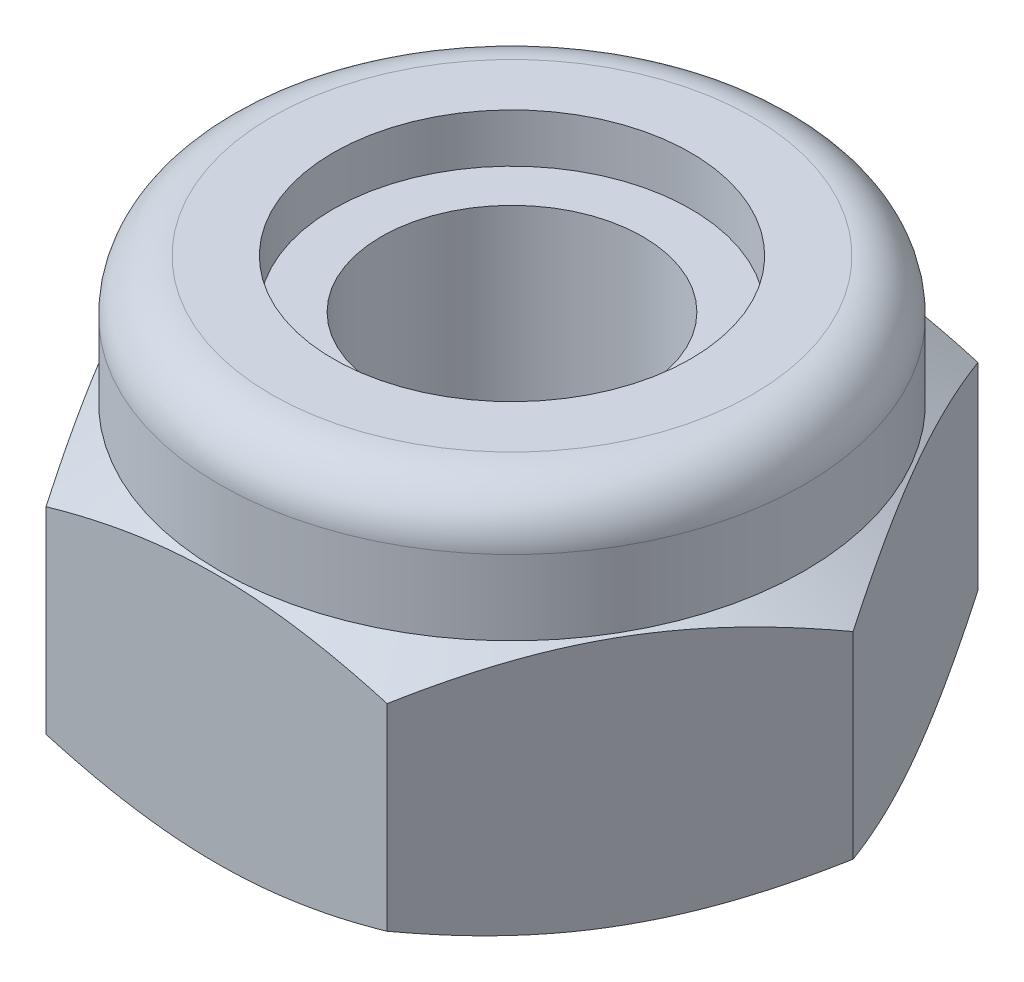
ISO-10303-21;
HEADER;
FILE_DESCRIPTION(('STEP AP214'),'2;1');
FILE_NAME('part.step','',(''),(''),'','','');
FILE_SCHEMA(('AUTOMOTIVE_DESIGN { 1 0 10303 214 1 1 1 1 }'));
ENDSEC;
DATA;
#1=APPLICATION_CONTEXT('core data for automotive mechanical design processes');
#2=APPLICATION_PROTOCOL_DEFINITION('international standard','automotive_design',2000,#1);
#3=PRODUCT_CONTEXT('',#1,'mechanical');
#4=PRODUCT('Part','Part','',(#3));
#5=PRODUCT_RELATED_PRODUCT_CATEGORY('part','',(#4));
#6=PRODUCT_DEFINITION_FORMATION('','',#4);
#7=PRODUCT_DEFINITION_CONTEXT('part definition',#1,'design');
#8=PRODUCT_DEFINITION('design','',#6,#7);
#9=PRODUCT_DEFINITION_SHAPE('','',#8);
#10=(LENGTH_UNIT() NAMED_UNIT(*) SI_UNIT(.MILLI.,.METRE.));
#11=(NAMED_UNIT(*) PLANE_ANGLE_UNIT() SI_UNIT($,.RADIAN.));
#12=(NAMED_UNIT(*) SI_UNIT($,.STERADIAN.) SOLID_ANGLE_UNIT());
#13=UNCERTAINTY_MEASURE_WITH_UNIT(LENGTH_MEASURE(1.E-05),#10,'distance_accuracy_value','');
#14=(GEOMETRIC_REPRESENTATION_CONTEXT(3) GLOBAL_UNCERTAINTY_ASSIGNED_CONTEXT((#13)) GLOBAL_UNIT_ASSIGNED_CONTEXT((#10,
#11,#12)) REPRESENTATION_CONTEXT('',''));
#15=CARTESIAN_POINT('',(0.,0.,0.));
#16=DIRECTION('',(0.,0.,1.));
#17=DIRECTION('',(1.,0.,0.));
#18=AXIS2_PLACEMENT_3D('',#15,#16,#17);
#19=CARTESIAN_POINT('',(-4.00050000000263,5.9436,2.30968975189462));
#20=DIRECTION('',(0.866025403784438,0.,-0.5));
#21=DIRECTION('',(0.,-1.,0.));
#22=AXIS2_PLACEMENT_3D('',#19,#20,#21);
#23=PLANE('',#22);
#24=CARTESIAN_POINT('',(-5.33400000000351,0.439940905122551,0.));
#25=CARTESIAN_POINT('',(-5.21680150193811,0.372256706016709,0.202993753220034));
#26=CARTESIAN_POINT('',(-5.09859134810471,0.310701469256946,0.407739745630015));
#27=CARTESIAN_POINT('',(-4.86012431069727,0.203258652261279,0.820776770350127));
#28=CARTESIAN_POINT('',(-4.73986319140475,0.157409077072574,1.02907513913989));
#29=CARTESIAN_POINT('',(-4.50083128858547,0.0860409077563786,1.44309053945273));
#30=CARTESIAN_POINT('',(-4.38209727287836,0.0600472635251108,1.64874388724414));
#31=CARTESIAN_POINT('',(-4.14407085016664,0.0290220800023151,2.0610177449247));
#32=CARTESIAN_POINT('',(-4.02477930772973,0.0239648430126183,2.26763675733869));
#33=CARTESIAN_POINT('',(-3.80189585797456,0.0345124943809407,2.65368221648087));
#34=CARTESIAN_POINT('',(-3.69827050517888,0.0475275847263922,2.83316659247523));
#35=CARTESIAN_POINT('',(-3.49169488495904,0.0887694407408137,3.19096606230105));
#36=CARTESIAN_POINT('',(-3.3887453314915,0.117010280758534,3.36927991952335));
#37=CARTESIAN_POINT('',(-3.18174414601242,0.187606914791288,3.72781649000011));
#38=CARTESIAN_POINT('',(-3.07771869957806,0.230261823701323,3.90799384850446));
#39=CARTESIAN_POINT('',(-2.87121889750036,0.327070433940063,4.26566199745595));
#40=CARTESIAN_POINT('',(-2.76874189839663,0.381201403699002,4.4431573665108));
#41=CARTESIAN_POINT('',(-2.66700000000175,0.439940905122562,4.61937950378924));
#42=B_SPLINE_CURVE_WITH_KNOTS('',3,(#24,#25,#26,#27,#28,#29,#30,#31,#32,#33,#34,#35,#36,#37,#38,
#39,#40,#41),.UNSPECIFIED.,.F.,.F.,(4,2,2,2,2,2,2,2,4),(0.,0.732208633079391,1.46617677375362,
2.18198147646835,2.89690732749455,3.51929225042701,4.14225348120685,4.77902900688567,
5.4145548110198),.UNSPECIFIED.);
#43=CARTESIAN_POINT('',(-5.33400000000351,0.439940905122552,0.));
#44=VERTEX_POINT('',#43);
#45=CARTESIAN_POINT('',(-2.66700000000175,0.439940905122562,4.61937950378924));
#46=VERTEX_POINT('',#45);
#47=EDGE_CURVE('E237',#44,#46,#42,.T.);
#48=ORIENTED_EDGE('',*,*,#47,.T.);
#49=DIRECTION('',(0.,-1.,0.));
#50=VECTOR('',#49,1.);
#51=CARTESIAN_POINT('',(-2.66700000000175,5.9436,4.61937950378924));
#52=LINE('',#51,#50);
#53=CARTESIAN_POINT('',(-2.66700000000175,3.52245909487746,4.61937950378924));
#54=VERTEX_POINT('',#53);
#55=EDGE_CURVE('E92',#54,#46,#52,.T.);
#56=ORIENTED_EDGE('',*,*,#55,.F.);
#57=CARTESIAN_POINT('',(-2.66700000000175,3.52245909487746,4.61937950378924));
#58=CARTESIAN_POINT('',(-2.78419849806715,3.5901432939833,4.41638575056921));
#59=CARTESIAN_POINT('',(-2.90240865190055,3.65169853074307,4.21163975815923));
#60=CARTESIAN_POINT('',(-3.14087568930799,3.75914134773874,3.79860273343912));
#61=CARTESIAN_POINT('',(-3.26113680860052,3.80499092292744,3.59030436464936));
#62=CARTESIAN_POINT('',(-3.50016871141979,3.87635909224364,3.17628896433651));
#63=CARTESIAN_POINT('',(-3.61890272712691,3.90235273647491,2.9706356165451));
#64=CARTESIAN_POINT('',(-3.85692914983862,3.93337791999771,2.55836175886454));
#65=CARTESIAN_POINT('',(-3.97622069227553,3.9384351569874,2.35174274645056));
#66=CARTESIAN_POINT('',(-4.1991041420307,3.92788750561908,1.96569728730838));
#67=CARTESIAN_POINT('',(-4.30272949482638,3.91487241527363,1.78621291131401));
#68=CARTESIAN_POINT('',(-4.50930511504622,3.87363055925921,1.4284134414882));
#69=CARTESIAN_POINT('',(-4.61225466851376,3.84538971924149,1.2500995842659));
#70=CARTESIAN_POINT('',(-4.81925585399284,3.77479308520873,0.891563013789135));
#71=CARTESIAN_POINT('',(-4.9232813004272,3.7321381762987,0.711385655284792));
#72=CARTESIAN_POINT('',(-5.1297811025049,3.63532956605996,0.353717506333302));
#73=CARTESIAN_POINT('',(-5.23225810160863,3.58119859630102,0.176222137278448));
#74=CARTESIAN_POINT('',(-5.33400000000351,3.52245909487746,0.));
#75=B_SPLINE_CURVE_WITH_KNOTS('',3,(#57,#58,#59,#60,#61,#62,#63,#64,#65,#66,#67,#68,#69,#70,#71,
#72,#73,#74),.UNSPECIFIED.,.F.,.F.,(4,2,2,2,2,2,2,2,4),(0.,0.732208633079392,1.46617677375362,
2.18198147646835,2.89690732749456,3.51929225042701,4.14225348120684,4.77902900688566,
5.4145548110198),.UNSPECIFIED.);
#76=CARTESIAN_POINT('',(-5.33400000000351,3.52245909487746,0.));
#77=VERTEX_POINT('',#76);
#78=EDGE_CURVE('E22',#54,#77,#75,.T.);
#79=ORIENTED_EDGE('',*,*,#78,.T.);
#80=DIRECTION('',(0.,-1.,0.));
#81=VECTOR('',#80,1.);
#82=CARTESIAN_POINT('',(-5.33400000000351,5.9436,0.));
#83=LINE('',#82,#81);
#84=EDGE_CURVE('E11',#77,#44,#83,.T.);
#85=ORIENTED_EDGE('',*,*,#84,.T.);
#86=EDGE_LOOP('',(#48,#56,#79,#85));
#87=FACE_BOUND('',#86,.T.);
#88=ADVANCED_FACE('F17',(#87),#23,.F.);
#89=CARTESIAN_POINT('',(-4.00050000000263,5.9436,-2.30968975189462));
#90=DIRECTION('',(0.866025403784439,0.,0.5));
#91=DIRECTION('',(0.,-1.,0.));
#92=AXIS2_PLACEMENT_3D('',#89,#90,#91);
#93=PLANE('',#92);
#94=CARTESIAN_POINT('',(-2.66700000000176,0.439940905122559,-4.61937950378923));
#95=CARTESIAN_POINT('',(-2.78419849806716,0.372256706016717,-4.4163857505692));
#96=CARTESIAN_POINT('',(-2.90240865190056,0.310701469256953,-4.21163975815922));
#97=CARTESIAN_POINT('',(-3.14087568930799,0.203258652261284,-3.79860273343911));
#98=CARTESIAN_POINT('',(-3.26113680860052,0.157409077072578,-3.59030436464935));
#99=CARTESIAN_POINT('',(-3.50016871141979,0.0860409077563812,-3.1762889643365));
#100=CARTESIAN_POINT('',(-3.61890272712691,0.0600472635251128,-2.97063561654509));
#101=CARTESIAN_POINT('',(-3.85692914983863,0.0290220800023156,-2.55836175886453));
#102=CARTESIAN_POINT('',(-3.97622069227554,0.0239648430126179,-2.35174274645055));
#103=CARTESIAN_POINT('',(-4.19910414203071,0.034512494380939,-1.96569728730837));
#104=CARTESIAN_POINT('',(-4.30272949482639,0.0475275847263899,-1.786212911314));
#105=CARTESIAN_POINT('',(-4.50930511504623,0.0887694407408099,-1.42841344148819));
#106=CARTESIAN_POINT('',(-4.61225466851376,0.117010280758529,-1.25009958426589));
#107=CARTESIAN_POINT('',(-4.81925585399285,0.187606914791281,-0.891563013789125));
#108=CARTESIAN_POINT('',(-4.9232813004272,0.230261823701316,-0.711385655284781));
#109=CARTESIAN_POINT('',(-5.1297811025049,0.327070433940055,-0.35371750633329));
#110=CARTESIAN_POINT('',(-5.23225810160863,0.381201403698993,-0.176222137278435));
#111=CARTESIAN_POINT('',(-5.33400000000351,0.439940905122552,0.));
#112=B_SPLINE_CURVE_WITH_KNOTS('',3,(#94,#95,#96,#97,#98,#99,#100,#101,#102,#103,#104,#105,#106,
#107,#108,#109,#110,#111),.UNSPECIFIED.,.F.,.F.,(4,2,2,2,2,2,2,2,4),(0.,0.732208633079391,
1.46617677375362,2.18198147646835,2.89690732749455,3.519292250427,4.14225348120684,
4.77902900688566,5.4145548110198),.UNSPECIFIED.);
#113=CARTESIAN_POINT('',(-2.66700000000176,0.439940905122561,-4.61937950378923));
#114=VERTEX_POINT('',#113);
#115=EDGE_CURVE('E103',#114,#44,#112,.T.);
#116=ORIENTED_EDGE('',*,*,#115,.T.);
#117=ORIENTED_EDGE('',*,*,#84,.F.);
#118=CARTESIAN_POINT('',(-5.33400000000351,3.52245909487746,0.));
#119=CARTESIAN_POINT('',(-5.21680150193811,3.5901432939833,-0.202993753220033));
#120=CARTESIAN_POINT('',(-5.09859134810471,3.65169853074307,-0.407739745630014));
#121=CARTESIAN_POINT('',(-4.86012431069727,3.75914134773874,-0.820776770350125));
#122=CARTESIAN_POINT('',(-4.73986319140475,3.80499092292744,-1.02907513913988));
#123=CARTESIAN_POINT('',(-4.50083128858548,3.87635909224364,-1.44309053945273));
#124=CARTESIAN_POINT('',(-4.38209727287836,3.90235273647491,-1.64874388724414));
#125=CARTESIAN_POINT('',(-4.14407085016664,3.93337791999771,-2.0610177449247));
#126=CARTESIAN_POINT('',(-4.02477930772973,3.9384351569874,-2.26763675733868));
#127=CARTESIAN_POINT('',(-3.80189585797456,3.92788750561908,-2.65368221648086));
#128=CARTESIAN_POINT('',(-3.69827050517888,3.91487241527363,-2.83316659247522));
#129=CARTESIAN_POINT('',(-3.49169488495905,3.87363055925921,-3.19096606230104));
#130=CARTESIAN_POINT('',(-3.38874533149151,3.84538971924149,-3.36927991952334));
#131=CARTESIAN_POINT('',(-3.18174414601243,3.77479308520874,-3.7278164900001));
#132=CARTESIAN_POINT('',(-3.07771869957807,3.7321381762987,-3.90799384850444));
#133=CARTESIAN_POINT('',(-2.87121889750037,3.63532956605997,-4.26566199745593));
#134=CARTESIAN_POINT('',(-2.76874189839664,3.58119859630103,-4.44315736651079));
#135=CARTESIAN_POINT('',(-2.66700000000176,3.52245909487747,-4.61937950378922));
#136=B_SPLINE_CURVE_WITH_KNOTS('',3,(#118,#119,#120,#121,#122,#123,#124,#125,#126,#127,#128,
#129,#130,#131,#132,#133,#134,#135),.UNSPECIFIED.,.F.,.F.,(4,2,2,2,2,2,2,2,4),(0.,
0.732208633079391,1.46617677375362,2.18198147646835,2.89690732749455,3.519292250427,
4.14225348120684,4.77902900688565,5.41455481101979),.UNSPECIFIED.);
#137=CARTESIAN_POINT('',(-2.66700000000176,3.52245909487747,-4.61937950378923));
#138=VERTEX_POINT('',#137);
#139=EDGE_CURVE('E100',#77,#138,#136,.T.);
#140=ORIENTED_EDGE('',*,*,#139,.T.);
#141=DIRECTION('',(0.,-1.,0.));
#142=VECTOR('',#141,1.);
#143=CARTESIAN_POINT('',(-2.66700000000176,5.9436,-4.61937950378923));
#144=LINE('',#143,#142);
#145=EDGE_CURVE('E35',#138,#114,#144,.T.);
#146=ORIENTED_EDGE('',*,*,#145,.T.);
#147=EDGE_LOOP('',(#116,#117,#140,#146));
#148=FACE_BOUND('',#147,.T.);
#149=ADVANCED_FACE('F19',(#148),#93,.F.);
#150=CARTESIAN_POINT('',(0.,5.9436,-4.61937950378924));
#151=DIRECTION('',(0.,0.,1.));
#152=DIRECTION('',(1.,0.,0.));
#153=AXIS2_PLACEMENT_3D('',#150,#151,#152);
#154=PLANE('',#153);
#155=CARTESIAN_POINT('',(2.66700000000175,0.439940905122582,-4.61937950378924));
#156=CARTESIAN_POINT('',(2.43260300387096,0.37225670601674,-4.61937950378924));
#157=CARTESIAN_POINT('',(2.19618269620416,0.310701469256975,-4.61937950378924));
#158=CARTESIAN_POINT('',(1.71924862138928,0.203258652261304,-4.61937950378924));
#159=CARTESIAN_POINT('',(1.47872638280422,0.157409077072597,-4.61937950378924));
#160=CARTESIAN_POINT('',(1.00066257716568,0.0860409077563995,-4.61937950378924));
#161=CARTESIAN_POINT('',(0.763194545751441,0.0600472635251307,-4.61937950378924));
#162=CARTESIAN_POINT('',(0.287141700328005,0.0290220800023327,-4.61937950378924));
#163=CARTESIAN_POINT('',(0.0485586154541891,0.0239648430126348,-4.61937950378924));
#164=CARTESIAN_POINT('',(-0.397208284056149,0.0345124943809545,-4.61937950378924));
#165=CARTESIAN_POINT('',(-0.604458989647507,0.0475275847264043,-4.61937950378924));
#166=CARTESIAN_POINT('',(-1.01761023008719,0.0887694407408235,-4.61937950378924));
#167=CARTESIAN_POINT('',(-1.22350933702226,0.117010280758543,-4.61937950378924));
#168=CARTESIAN_POINT('',(-1.63751170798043,0.187606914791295,-4.61937950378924));
#169=CARTESIAN_POINT('',(-1.84556260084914,0.230261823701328,-4.61937950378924));
#170=CARTESIAN_POINT('',(-2.25856220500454,0.327070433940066,-4.61937950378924));
#171=CARTESIAN_POINT('',(-2.463516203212,0.381201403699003,-4.61937950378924));
#172=CARTESIAN_POINT('',(-2.66700000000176,0.439940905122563,-4.61937950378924));
#173=B_SPLINE_CURVE_WITH_KNOTS('',3,(#155,#156,#157,#158,#159,#160,#161,#162,#163,#164,#165,
#166,#167,#168,#169,#170,#171,#172),.UNSPECIFIED.,.F.,.F.,(4,2,2,2,2,2,2,2,4),(0.,
0.732208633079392,1.46617677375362,2.18198147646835,2.89690732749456,3.51929225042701,
4.14225348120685,4.77902900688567,5.4145548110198),.UNSPECIFIED.);
#174=CARTESIAN_POINT('',(2.66700000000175,0.439940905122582,-4.61937950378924));
#175=VERTEX_POINT('',#174);
#176=EDGE_CURVE('E224',#175,#114,#173,.T.);
#177=ORIENTED_EDGE('',*,*,#176,.T.);
#178=ORIENTED_EDGE('',*,*,#145,.F.);
#179=CARTESIAN_POINT('',(-2.66700000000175,3.52245909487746,-4.61937950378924));
#180=CARTESIAN_POINT('',(-2.43260300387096,3.59014329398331,-4.61937950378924));
#181=CARTESIAN_POINT('',(-2.19618269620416,3.65169853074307,-4.61937950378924));
#182=CARTESIAN_POINT('',(-1.71924862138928,3.75914134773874,-4.61937950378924));
#183=CARTESIAN_POINT('',(-1.47872638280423,3.80499092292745,-4.61937950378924));
#184=CARTESIAN_POINT('',(-1.00066257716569,3.87635909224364,-4.61937950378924));
#185=CARTESIAN_POINT('',(-0.763194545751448,3.90235273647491,-4.61937950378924));
#186=CARTESIAN_POINT('',(-0.287141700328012,3.93337791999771,-4.61937950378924));
#187=CARTESIAN_POINT('',(-0.0485586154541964,3.93843515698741,-4.61937950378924));
#188=CARTESIAN_POINT('',(0.397208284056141,3.92788750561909,-4.61937950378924));
#189=CARTESIAN_POINT('',(0.604458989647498,3.91487241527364,-4.61937950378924));
#190=CARTESIAN_POINT('',(1.01761023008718,3.87363055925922,-4.61937950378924));
#191=CARTESIAN_POINT('',(1.22350933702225,3.8453897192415,-4.61937950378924));
#192=CARTESIAN_POINT('',(1.63751170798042,3.77479308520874,-4.61937950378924));
#193=CARTESIAN_POINT('',(1.84556260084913,3.73213817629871,-4.61937950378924));
#194=CARTESIAN_POINT('',(2.25856220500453,3.63532956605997,-4.61937950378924));
#195=CARTESIAN_POINT('',(2.46351620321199,3.58119859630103,-4.61937950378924));
#196=CARTESIAN_POINT('',(2.66700000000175,3.52245909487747,-4.61937950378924));
#197=B_SPLINE_CURVE_WITH_KNOTS('',3,(#179,#180,#181,#182,#183,#184,#185,#186,#187,#188,#189,
#190,#191,#192,#193,#194,#195,#196),.UNSPECIFIED.,.F.,.F.,(4,2,2,2,2,2,2,2,4),(0.,
0.732208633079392,1.46617677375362,2.18198147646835,2.89690732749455,3.519292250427,
4.14225348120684,4.77902900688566,5.41455481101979),.UNSPECIFIED.);
#198=CARTESIAN_POINT('',(2.66700000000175,3.52245909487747,-4.61937950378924));
#199=VERTEX_POINT('',#198);
#200=EDGE_CURVE('E111',#138,#199,#197,.T.);
#201=ORIENTED_EDGE('',*,*,#200,.T.);
#202=DIRECTION('',(0.,-1.,0.));
#203=VECTOR('',#202,1.);
#204=CARTESIAN_POINT('',(2.66700000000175,5.9436,-4.61937950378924));
#205=LINE('',#204,#203);
#206=EDGE_CURVE('E143',#199,#175,#205,.T.);
#207=ORIENTED_EDGE('',*,*,#206,.T.);
#208=EDGE_LOOP('',(#177,#178,#201,#207));
#209=FACE_BOUND('',#208,.T.);
#210=ADVANCED_FACE('F212',(#209),#154,.F.);
#211=CARTESIAN_POINT('',(4.00050000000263,5.9436,-2.30968975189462));
#212=DIRECTION('',(-0.866025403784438,0.,0.5));
#213=DIRECTION('',(0.,1.,0.));
#214=AXIS2_PLACEMENT_3D('',#211,#212,#213);
#215=PLANE('',#214);
#216=CARTESIAN_POINT('',(5.33400000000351,0.439940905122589,0.));
#217=CARTESIAN_POINT('',(5.21680150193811,0.372256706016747,-0.202993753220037));
#218=CARTESIAN_POINT('',(5.09859134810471,0.310701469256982,-0.407739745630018));
#219=CARTESIAN_POINT('',(4.86012431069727,0.203258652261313,-0.820776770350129));
#220=CARTESIAN_POINT('',(4.73986319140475,0.157409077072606,-1.02907513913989));
#221=CARTESIAN_POINT('',(4.50083128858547,0.0860409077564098,-1.44309053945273));
#222=CARTESIAN_POINT('',(4.38209727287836,0.0600472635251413,-1.64874388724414));
#223=CARTESIAN_POINT('',(4.14407085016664,0.029022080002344,-2.06101774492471));
#224=CARTESIAN_POINT('',(4.02477930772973,0.0239648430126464,-2.26763675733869));
#225=CARTESIAN_POINT('',(3.80189585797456,0.0345124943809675,-2.65368221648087));
#226=CARTESIAN_POINT('',(3.69827050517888,0.0475275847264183,-2.83316659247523));
#227=CARTESIAN_POINT('',(3.49169488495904,0.0887694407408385,-3.19096606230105));
#228=CARTESIAN_POINT('',(3.3887453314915,0.117010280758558,-3.36927991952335));
#229=CARTESIAN_POINT('',(3.18174414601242,0.187606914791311,-3.72781649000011));
#230=CARTESIAN_POINT('',(3.07771869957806,0.230261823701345,-3.90799384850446));
#231=CARTESIAN_POINT('',(2.87121889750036,0.327070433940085,-4.26566199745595));
#232=CARTESIAN_POINT('',(2.76874189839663,0.381201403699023,-4.4431573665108));
#233=CARTESIAN_POINT('',(2.66700000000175,0.439940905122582,-4.61937950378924));
#234=B_SPLINE_CURVE_WITH_KNOTS('',3,(#216,#217,#218,#219,#220,#221,#222,#223,#224,#225,#226,
#227,#228,#229,#230,#231,#232,#233),.UNSPECIFIED.,.F.,.F.,(4,2,2,2,2,2,2,2,4),(0.,
0.732208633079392,1.46617677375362,2.18198147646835,2.89690732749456,3.51929225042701,
4.14225348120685,4.77902900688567,5.4145548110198),.UNSPECIFIED.);
#235=CARTESIAN_POINT('',(5.33400000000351,0.439940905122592,0.));
#236=VERTEX_POINT('',#235);
#237=EDGE_CURVE('E216',#236,#175,#234,.T.);
#238=ORIENTED_EDGE('',*,*,#237,.T.);
#239=ORIENTED_EDGE('',*,*,#206,.F.);
#240=CARTESIAN_POINT('',(2.66700000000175,3.52245909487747,-4.61937950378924));
#241=CARTESIAN_POINT('',(2.78419849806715,3.59014329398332,-4.41638575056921));
#242=CARTESIAN_POINT('',(2.90240865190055,3.65169853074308,-4.21163975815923));
#243=CARTESIAN_POINT('',(3.14087568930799,3.75914134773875,-3.79860273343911));
#244=CARTESIAN_POINT('',(3.26113680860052,3.80499092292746,-3.59030436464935));
#245=CARTESIAN_POINT('',(3.50016871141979,3.87635909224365,-3.17628896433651));
#246=CARTESIAN_POINT('',(3.61890272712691,3.90235273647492,-2.9706356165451));
#247=CARTESIAN_POINT('',(3.85692914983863,3.93337791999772,-2.55836175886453));
#248=CARTESIAN_POINT('',(3.97622069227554,3.93843515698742,-2.35174274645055));
#249=CARTESIAN_POINT('',(4.19910414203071,3.9278875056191,-1.96569728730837));
#250=CARTESIAN_POINT('',(4.30272949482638,3.91487241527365,-1.78621291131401));
#251=CARTESIAN_POINT('',(4.50930511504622,3.87363055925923,-1.42841344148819));
#252=CARTESIAN_POINT('',(4.61225466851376,3.84538971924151,-1.25009958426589));
#253=CARTESIAN_POINT('',(4.81925585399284,3.77479308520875,-0.891563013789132));
#254=CARTESIAN_POINT('',(4.9232813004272,3.73213817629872,-0.711385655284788));
#255=CARTESIAN_POINT('',(5.1297811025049,3.63532956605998,-0.353717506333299));
#256=CARTESIAN_POINT('',(5.23225810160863,3.58119859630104,-0.176222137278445));
#257=CARTESIAN_POINT('',(5.33400000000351,3.52245909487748,0.));
#258=B_SPLINE_CURVE_WITH_KNOTS('',3,(#240,#241,#242,#243,#244,#245,#246,#247,#248,#249,#250,
#251,#252,#253,#254,#255,#256,#257),.UNSPECIFIED.,.F.,.F.,(4,2,2,2,2,2,2,2,4),(0.,
0.732208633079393,1.46617677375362,2.18198147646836,2.89690732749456,3.51929225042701,
4.14225348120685,4.77902900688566,5.4145548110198),.UNSPECIFIED.);
#259=CARTESIAN_POINT('',(5.33400000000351,3.52245909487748,0.));
#260=VERTEX_POINT('',#259);
#261=EDGE_CURVE('E181',#199,#260,#258,.T.);
#262=ORIENTED_EDGE('',*,*,#261,.T.);
#263=DIRECTION('',(0.,-1.,0.));
#264=VECTOR('',#263,1.);
#265=CARTESIAN_POINT('',(5.33400000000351,5.9436,0.));
#266=LINE('',#265,#264);
#267=EDGE_CURVE('E146',#260,#236,#266,.T.);
#268=ORIENTED_EDGE('',*,*,#267,.T.);
#269=EDGE_LOOP('',(#238,#239,#262,#268));
#270=FACE_BOUND('',#269,.T.);
#271=ADVANCED_FACE('F205',(#270),#215,.F.);
#272=CARTESIAN_POINT('',(4.00050000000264,5.9436,2.30968975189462));
#273=DIRECTION('',(-0.866025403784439,0.,-0.5));
#274=DIRECTION('',(-0.5,0.,0.866025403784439));
#275=AXIS2_PLACEMENT_3D('',#272,#273,#274);
#276=PLANE('',#275);
#277=CARTESIAN_POINT('',(2.66700000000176,0.43994090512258,4.61937950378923));
#278=CARTESIAN_POINT('',(2.78419849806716,0.372256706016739,4.4163857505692));
#279=CARTESIAN_POINT('',(2.90240865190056,0.310701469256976,4.21163975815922));
#280=CARTESIAN_POINT('',(3.140875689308,0.203258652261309,3.79860273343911));
#281=CARTESIAN_POINT('',(3.26113680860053,0.157409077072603,3.59030436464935));
#282=CARTESIAN_POINT('',(3.5001687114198,0.0860409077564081,3.1762889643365));
#283=CARTESIAN_POINT('',(3.61890272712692,0.0600472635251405,2.97063561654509));
#284=CARTESIAN_POINT('',(3.85692914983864,0.0290220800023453,2.55836175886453));
#285=CARTESIAN_POINT('',(3.97622069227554,0.0239648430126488,2.35174274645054));
#286=CARTESIAN_POINT('',(4.19910414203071,0.0345124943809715,1.96569728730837));
#287=CARTESIAN_POINT('',(4.30272949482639,0.0475275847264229,1.786212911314));
#288=CARTESIAN_POINT('',(4.50930511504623,0.0887694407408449,1.42841344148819));
#289=CARTESIAN_POINT('',(4.61225466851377,0.117010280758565,1.25009958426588));
#290=CARTESIAN_POINT('',(4.81925585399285,0.18760691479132,0.891563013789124));
#291=CARTESIAN_POINT('',(4.92328130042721,0.230261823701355,0.71138565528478));
#292=CARTESIAN_POINT('',(5.12978110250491,0.327070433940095,0.35371750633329));
#293=CARTESIAN_POINT('',(5.23225810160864,0.381201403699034,0.176222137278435));
#294=CARTESIAN_POINT('',(5.33400000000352,0.439940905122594,0.));
#295=B_SPLINE_CURVE_WITH_KNOTS('',3,(#277,#278,#279,#280,#281,#282,#283,#284,#285,#286,#287,
#288,#289,#290,#291,#292,#293,#294),.UNSPECIFIED.,.F.,.F.,(4,2,2,2,2,2,2,2,4),(0.,
0.732208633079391,1.46617677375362,2.18198147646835,2.89690732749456,3.51929225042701,
4.14225348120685,4.77902900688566,5.4145548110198),.UNSPECIFIED.);
#296=CARTESIAN_POINT('',(2.66700000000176,0.439940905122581,4.61937950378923));
#297=VERTEX_POINT('',#296);
#298=EDGE_CURVE('E139',#297,#236,#295,.T.);
#299=ORIENTED_EDGE('',*,*,#298,.T.);
#300=ORIENTED_EDGE('',*,*,#267,.F.);
#301=CARTESIAN_POINT('',(5.33400000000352,3.52245909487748,0.));
#302=CARTESIAN_POINT('',(5.21680150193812,3.59014329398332,0.202993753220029));
#303=CARTESIAN_POINT('',(5.09859134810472,3.65169853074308,0.407739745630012));
#304=CARTESIAN_POINT('',(4.86012431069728,3.75914134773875,0.820776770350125));
#305=CARTESIAN_POINT('',(4.73986319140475,3.80499092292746,1.02907513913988));
#306=CARTESIAN_POINT('',(4.50083128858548,3.87635909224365,1.44309053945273));
#307=CARTESIAN_POINT('',(4.38209727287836,3.90235273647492,1.64874388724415));
#308=CARTESIAN_POINT('',(4.14407085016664,3.93337791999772,2.06101774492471));
#309=CARTESIAN_POINT('',(4.02477930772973,3.93843515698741,2.26763675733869));
#310=CARTESIAN_POINT('',(3.80189585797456,3.92788750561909,2.65368221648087));
#311=CARTESIAN_POINT('',(3.69827050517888,3.91487241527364,2.83316659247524));
#312=CARTESIAN_POINT('',(3.49169488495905,3.87363055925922,3.19096606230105));
#313=CARTESIAN_POINT('',(3.38874533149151,3.8453897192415,3.36927991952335));
#314=CARTESIAN_POINT('',(3.18174414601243,3.77479308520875,3.72781649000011));
#315=CARTESIAN_POINT('',(3.07771869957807,3.73213817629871,3.90799384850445));
#316=CARTESIAN_POINT('',(2.87121889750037,3.63532956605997,4.26566199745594));
#317=CARTESIAN_POINT('',(2.76874189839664,3.58119859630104,4.44315736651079));
#318=CARTESIAN_POINT('',(2.66700000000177,3.52245909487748,4.61937950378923));
#319=B_SPLINE_CURVE_WITH_KNOTS('',3,(#301,#302,#303,#304,#305,#306,#307,#308,#309,#310,#311,
#312,#313,#314,#315,#316,#317,#318),.UNSPECIFIED.,.F.,.F.,(4,2,2,2,2,2,2,2,4),(0.,
0.732208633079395,1.46617677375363,2.18198147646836,2.89690732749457,3.51929225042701,
4.14225348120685,4.77902900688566,5.41455481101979),.UNSPECIFIED.);
#320=CARTESIAN_POINT('',(2.66700000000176,3.52245909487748,4.61937950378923));
#321=VERTEX_POINT('',#320);
#322=EDGE_CURVE('E122',#260,#321,#319,.T.);
#323=ORIENTED_EDGE('',*,*,#322,.T.);
#324=DIRECTION('',(0.,-1.,0.));
#325=VECTOR('',#324,1.);
#326=CARTESIAN_POINT('',(2.66700000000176,5.9436,4.61937950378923));
#327=LINE('',#326,#325);
#328=EDGE_CURVE('E113',#321,#297,#327,.T.);
#329=ORIENTED_EDGE('',*,*,#328,.T.);
#330=EDGE_LOOP('',(#299,#300,#323,#329));
#331=FACE_BOUND('',#330,.T.);
#332=ADVANCED_FACE('F201',(#331),#276,.F.);
#333=CARTESIAN_POINT('',(0.,5.9436,4.61937950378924));
#334=DIRECTION('',(0.,0.,-1.));
#335=DIRECTION('',(-1.,0.,0.));
#336=AXIS2_PLACEMENT_3D('',#333,#334,#335);
#337=PLANE('',#336);
#338=CARTESIAN_POINT('',(-2.66700000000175,0.439940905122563,4.61937950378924));
#339=CARTESIAN_POINT('',(-2.43260300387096,0.372256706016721,4.61937950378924));
#340=CARTESIAN_POINT('',(-2.19618269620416,0.310701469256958,4.61937950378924));
#341=CARTESIAN_POINT('',(-1.71924862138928,0.203258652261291,4.61937950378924));
#342=CARTESIAN_POINT('',(-1.47872638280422,0.157409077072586,4.61937950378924));
#343=CARTESIAN_POINT('',(-1.00066257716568,0.086040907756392,4.61937950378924));
#344=CARTESIAN_POINT('',(-0.763194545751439,0.0600472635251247,4.61937950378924));
#345=CARTESIAN_POINT('',(-0.287141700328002,0.0290220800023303,4.61937950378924));
#346=CARTESIAN_POINT('',(-0.0485586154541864,0.0239648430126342,4.61937950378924));
#347=CARTESIAN_POINT('',(0.397208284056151,0.0345124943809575,4.61937950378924));
#348=CARTESIAN_POINT('',(0.60445898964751,0.047527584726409,4.61937950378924));
#349=CARTESIAN_POINT('',(1.01761023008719,0.0887694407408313,4.61937950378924));
#350=CARTESIAN_POINT('',(1.22350933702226,0.117010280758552,4.61937950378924));
#351=CARTESIAN_POINT('',(1.63751170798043,0.187606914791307,4.61937950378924));
#352=CARTESIAN_POINT('',(1.84556260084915,0.230261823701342,4.61937950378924));
#353=CARTESIAN_POINT('',(2.25856220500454,0.327070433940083,4.61937950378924));
#354=CARTESIAN_POINT('',(2.46351620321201,0.381201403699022,4.61937950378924));
#355=CARTESIAN_POINT('',(2.66700000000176,0.439940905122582,4.61937950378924));
#356=B_SPLINE_CURVE_WITH_KNOTS('',3,(#338,#339,#340,#341,#342,#343,#344,#345,#346,#347,#348,
#349,#350,#351,#352,#353,#354,#355),.UNSPECIFIED.,.F.,.F.,(4,2,2,2,2,2,2,2,4),(0.,
0.732208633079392,1.46617677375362,2.18198147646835,2.89690732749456,3.51929225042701,
4.14225348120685,4.77902900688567,5.4145548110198),.UNSPECIFIED.);
#357=EDGE_CURVE('E243',#46,#297,#356,.T.);
#358=ORIENTED_EDGE('',*,*,#357,.T.);
#359=ORIENTED_EDGE('',*,*,#328,.F.);
#360=CARTESIAN_POINT('',(2.66700000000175,3.52245909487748,4.61937950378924));
#361=CARTESIAN_POINT('',(2.43260300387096,3.59014329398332,4.61937950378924));
#362=CARTESIAN_POINT('',(2.19618269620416,3.65169853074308,4.61937950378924));
#363=CARTESIAN_POINT('',(1.71924862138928,3.75914134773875,4.61937950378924));
#364=CARTESIAN_POINT('',(1.47872638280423,3.80499092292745,4.61937950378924));
#365=CARTESIAN_POINT('',(1.00066257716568,3.87635909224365,4.61937950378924));
#366=CARTESIAN_POINT('',(0.763194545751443,3.90235273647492,4.61937950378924));
#367=CARTESIAN_POINT('',(0.287141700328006,3.93337791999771,4.61937950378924));
#368=CARTESIAN_POINT('',(0.0485586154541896,3.93843515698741,4.61937950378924));
#369=CARTESIAN_POINT('',(-0.397208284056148,3.92788750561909,4.61937950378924));
#370=CARTESIAN_POINT('',(-0.604458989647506,3.91487241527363,4.61937950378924));
#371=CARTESIAN_POINT('',(-1.01761023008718,3.87363055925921,4.61937950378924));
#372=CARTESIAN_POINT('',(-1.22350933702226,3.84538971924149,4.61937950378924));
#373=CARTESIAN_POINT('',(-1.63751170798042,3.77479308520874,4.61937950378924));
#374=CARTESIAN_POINT('',(-1.84556260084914,3.7321381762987,4.61937950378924));
#375=CARTESIAN_POINT('',(-2.25856220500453,3.63532956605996,4.61937950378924));
#376=CARTESIAN_POINT('',(-2.463516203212,3.58119859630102,4.61937950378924));
#377=CARTESIAN_POINT('',(-2.66700000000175,3.52245909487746,4.61937950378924));
#378=B_SPLINE_CURVE_WITH_KNOTS('',3,(#360,#361,#362,#363,#364,#365,#366,#367,#368,#369,#370,
#371,#372,#373,#374,#375,#376,#377),.UNSPECIFIED.,.F.,.F.,(4,2,2,2,2,2,2,2,4),(0.,
0.732208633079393,1.46617677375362,2.18198147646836,2.89690732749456,3.51929225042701,
4.14225348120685,4.77902900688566,5.4145548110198),.UNSPECIFIED.);
#379=EDGE_CURVE('E116',#321,#54,#378,.T.);
#380=ORIENTED_EDGE('',*,*,#379,.T.);
#381=ORIENTED_EDGE('',*,*,#55,.T.);
#382=EDGE_LOOP('',(#358,#359,#380,#381));
#383=FACE_BOUND('',#382,.T.);
#384=ADVANCED_FACE('F204',(#383),#337,.F.);
#385=CARTESIAN_POINT('',(2.99720000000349,0.,0.));
#386=DIRECTION('',(0.,-1.,0.));
#387=DIRECTION('',(0.,0.,-1.));
#388=AXIS2_PLACEMENT_3D('',#385,#386,#387);
#389=PLANE('',#388);
#390=CARTESIAN_POINT('',(0.,0.,0.));
#391=DIRECTION('',(0.,-1.,0.));
#392=DIRECTION('',(1.,0.,0.));
#393=AXIS2_PLACEMENT_3D('',#390,#391,#392);
#394=CIRCLE('',#393,2.99720000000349);
#395=CARTESIAN_POINT('',(2.99720000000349,0.,0.));
#396=VERTEX_POINT('',#395);
#397=EDGE_CURVE('E273',#396,#396,#394,.T.);
#398=ORIENTED_EDGE('',*,*,#397,.F.);
#399=EDGE_LOOP('',(#398));
#400=FACE_BOUND('',#399,.T.);
#401=CARTESIAN_POINT('',(0.,0.,0.));
#402=DIRECTION('',(0.,-1.,0.));
#403=DIRECTION('',(1.,0.,0.));
#404=AXIS2_PLACEMENT_3D('',#401,#402,#403);
#405=CIRCLE('',#404,4.57200000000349);
#406=CARTESIAN_POINT('',(4.57200000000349,0.,0.));
#407=VERTEX_POINT('',#406);
#408=EDGE_CURVE('E137',#407,#407,#405,.T.);
#409=ORIENTED_EDGE('',*,*,#408,.T.);
#410=EDGE_LOOP('',(#409));
#411=FACE_BOUND('',#410,.T.);
#412=ADVANCED_FACE('F438',(#400,#411),#389,.T.);
#413=CARTESIAN_POINT('',(2.794000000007,5.1816,0.));
#414=DIRECTION('',(0.,1.,0.));
#415=DIRECTION('',(1.,0.,0.));
#416=AXIS2_PLACEMENT_3D('',#413,#414,#415);
#417=PLANE('',#416);
#418=CARTESIAN_POINT('',(0.,5.1816,0.));
#419=DIRECTION('',(0.,-1.,0.));
#420=DIRECTION('',(1.,0.,0.));
#421=AXIS2_PLACEMENT_3D('',#418,#419,#420);
#422=CIRCLE('',#421,2.04470000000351);
#423=CARTESIAN_POINT('',(2.04470000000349,5.18160000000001,0.));
#424=VERTEX_POINT('',#423);
#425=EDGE_CURVE('E282',#424,#424,#422,.T.);
#426=ORIENTED_EDGE('',*,*,#425,.T.);
#427=EDGE_LOOP('',(#426));
#428=FACE_BOUND('',#427,.T.);
#429=CARTESIAN_POINT('',(0.,5.1816,0.));
#430=DIRECTION('',(0.,-1.,0.));
#431=DIRECTION('',(1.,0.,0.));
#432=AXIS2_PLACEMENT_3D('',#429,#430,#431);
#433=CIRCLE('',#432,2.79400000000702);
#434=CARTESIAN_POINT('',(2.794000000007,5.18160000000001,0.));
#435=VERTEX_POINT('',#434);
#436=EDGE_CURVE('E289',#435,#435,#433,.T.);
#437=ORIENTED_EDGE('',*,*,#436,.F.);
#438=EDGE_LOOP('',(#437));
#439=FACE_BOUND('',#438,.T.);
#440=ADVANCED_FACE('F302',(#428,#439),#417,.T.);
#441=CARTESIAN_POINT('',(3.75920000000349,5.9436,0.));
#442=DIRECTION('',(0.,1.,0.));
#443=DIRECTION('',(1.,0.,0.));
#444=AXIS2_PLACEMENT_3D('',#441,#442,#443);
#445=PLANE('',#444);
#446=CARTESIAN_POINT('',(0.,5.9436,0.));
#447=DIRECTION('',(0.,-1.,0.));
#448=DIRECTION('',(1.,0.,0.));
#449=AXIS2_PLACEMENT_3D('',#446,#447,#448);
#450=CIRCLE('',#449,2.79400000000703);
#451=CARTESIAN_POINT('',(2.794000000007,5.94360000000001,0.));
#452=VERTEX_POINT('',#451);
#453=EDGE_CURVE('E287',#452,#452,#450,.T.);
#454=ORIENTED_EDGE('',*,*,#453,.T.);
#455=EDGE_LOOP('',(#454));
#456=FACE_BOUND('',#455,.T.);
#457=CARTESIAN_POINT('',(0.,5.9436,0.));
#458=DIRECTION('',(0.,-1.,0.));
#459=DIRECTION('',(1.,0.,0.));
#460=AXIS2_PLACEMENT_3D('',#457,#458,#459);
#461=CIRCLE('',#460,3.75920000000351);
#462=CARTESIAN_POINT('',(3.75920000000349,5.94360000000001,0.));
#463=VERTEX_POINT('',#462);
#464=EDGE_CURVE('E132',#463,#463,#461,.T.);
#465=ORIENTED_EDGE('',*,*,#464,.F.);
#466=EDGE_LOOP('',(#465));
#467=FACE_BOUND('',#466,.T.);
#468=ADVANCED_FACE('F298',(#456,#467),#445,.T.);
#469=CARTESIAN_POINT('',(0.,0.,0.));
#470=DIRECTION('',(0.,1.,0.));
#471=DIRECTION('',(-1.,0.,0.));
#472=AXIS2_PLACEMENT_3D('',#469,#470,#471);
#473=CONICAL_SURFACE('',#472,4.57200000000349,1.04719755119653);
#474=ORIENTED_EDGE('',*,*,#237,.F.);
#475=ORIENTED_EDGE('',*,*,#298,.F.);
#476=ORIENTED_EDGE('',*,*,#357,.F.);
#477=ORIENTED_EDGE('',*,*,#47,.F.);
#478=ORIENTED_EDGE('',*,*,#115,.F.);
#479=ORIENTED_EDGE('',*,*,#176,.F.);
#480=EDGE_LOOP('',(#474,#475,#476,#477,#478,#479));
#481=FACE_BOUND('',#480,.T.);
#482=ORIENTED_EDGE('',*,*,#408,.F.);
#483=EDGE_LOOP('',(#482));
#484=FACE_BOUND('',#483,.T.);
#485=ADVANCED_FACE('F167',(#481,#484),#473,.T.);
#486=CARTESIAN_POINT('',(0.,3.52245909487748,0.));
#487=DIRECTION('',(0.,-1.,0.));
#488=DIRECTION('',(1.,0.,0.));
#489=AXIS2_PLACEMENT_3D('',#486,#487,#488);
#490=CONICAL_SURFACE('',#489,5.3340000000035,1.04719755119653);
#491=ORIENTED_EDGE('',*,*,#139,.F.);
#492=ORIENTED_EDGE('',*,*,#78,.F.);
#493=ORIENTED_EDGE('',*,*,#379,.F.);
#494=ORIENTED_EDGE('',*,*,#322,.F.);
#495=ORIENTED_EDGE('',*,*,#261,.F.);
#496=ORIENTED_EDGE('',*,*,#200,.F.);
#497=EDGE_LOOP('',(#491,#492,#493,#494,#495,#496));
#498=FACE_BOUND('',#497,.T.);
#499=CARTESIAN_POINT('',(0.,3.9624,0.));
#500=DIRECTION('',(0.,-1.,0.));
#501=DIRECTION('',(1.,0.,0.));
#502=AXIS2_PLACEMENT_3D('',#499,#500,#501);
#503=CIRCLE('',#502,4.57200000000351);
#504=CARTESIAN_POINT('',(4.5720000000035,3.96240000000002,0.));
#505=VERTEX_POINT('',#504);
#506=EDGE_CURVE('E117',#505,#505,#503,.T.);
#507=ORIENTED_EDGE('',*,*,#506,.T.);
#508=EDGE_LOOP('',(#507));
#509=FACE_BOUND('',#508,.T.);
#510=ADVANCED_FACE('F107',(#498,#509),#490,.T.);
#511=CARTESIAN_POINT('',(3.49148336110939E-12,-1000.,0.));
#512=DIRECTION('',(0.,-1.,0.));
#513=DIRECTION('',(1.,0.,0.));
#514=AXIS2_PLACEMENT_3D('',#511,#512,#513);
#515=CYLINDRICAL_SURFACE('',#514,4.57200000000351);
#516=ORIENTED_EDGE('',*,*,#506,.F.);
#517=EDGE_LOOP('',(#516));
#518=FACE_BOUND('',#517,.T.);
#519=CARTESIAN_POINT('',(0.,5.1308000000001,0.));
#520=DIRECTION('',(0.,-1.,0.));
#521=DIRECTION('',(1.,0.,0.));
#522=AXIS2_PLACEMENT_3D('',#519,#520,#521);
#523=CIRCLE('',#522,4.57200000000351);
#524=CARTESIAN_POINT('',(4.57200000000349,5.13080000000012,0.));
#525=VERTEX_POINT('',#524);
#526=EDGE_CURVE('E125',#525,#525,#523,.T.);
#527=ORIENTED_EDGE('',*,*,#526,.T.);
#528=EDGE_LOOP('',(#527));
#529=FACE_BOUND('',#528,.T.);
#530=ADVANCED_FACE('F166',(#518,#529),#515,.T.);
#531=CARTESIAN_POINT('',(0.,5.1308,0.));
#532=DIRECTION('',(0.,-1.,0.));
#533=DIRECTION('',(1.,0.,0.));
#534=AXIS2_PLACEMENT_3D('',#531,#532,#533);
#535=TOROIDAL_SURFACE('',#534,3.75920000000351,0.8128);
#536=ORIENTED_EDGE('',*,*,#526,.F.);
#537=EDGE_LOOP('',(#536));
#538=FACE_BOUND('',#537,.T.);
#539=ORIENTED_EDGE('',*,*,#464,.T.);
#540=EDGE_LOOP('',(#539));
#541=FACE_BOUND('',#540,.T.);
#542=ADVANCED_FACE('F251',(#538,#541),#535,.T.);
#543=CARTESIAN_POINT('',(3.49148336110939E-12,-1000.,0.));
#544=DIRECTION('',(0.,-1.,0.));
#545=DIRECTION('',(1.,0.,0.));
#546=AXIS2_PLACEMENT_3D('',#543,#544,#545);
#547=CYLINDRICAL_SURFACE('',#546,2.79400000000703);
#548=ORIENTED_EDGE('',*,*,#436,.T.);
#549=EDGE_LOOP('',(#548));
#550=FACE_BOUND('',#549,.T.);
#551=ORIENTED_EDGE('',*,*,#453,.F.);
#552=EDGE_LOOP('',(#551));
#553=FACE_BOUND('',#552,.T.);
#554=ADVANCED_FACE('F255',(#550,#553),#547,.F.);
#555=CARTESIAN_POINT('',(3.49148336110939E-12,-1000.,0.));
#556=DIRECTION('',(0.,-1.,0.));
#557=DIRECTION('',(1.,0.,0.));
#558=AXIS2_PLACEMENT_3D('',#555,#556,#557);
#559=CYLINDRICAL_SURFACE('',#558,2.0447000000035);
#560=CARTESIAN_POINT('',(0.,0.952499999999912,0.));
#561=DIRECTION('',(0.,-1.,0.));
#562=DIRECTION('',(1.,0.,0.));
#563=AXIS2_PLACEMENT_3D('',#560,#561,#562);
#564=CIRCLE('',#563,2.0447000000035);
#565=CARTESIAN_POINT('',(2.04470000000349,0.952499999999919,0.));
#566=VERTEX_POINT('',#565);
#567=EDGE_CURVE('E276',#566,#566,#564,.T.);
#568=ORIENTED_EDGE('',*,*,#567,.T.);
#569=EDGE_LOOP('',(#568));
#570=FACE_BOUND('',#569,.T.);
#571=ORIENTED_EDGE('',*,*,#425,.F.);
#572=EDGE_LOOP('',(#571));
#573=FACE_BOUND('',#572,.T.);
#574=ADVANCED_FACE('F259',(#570,#573),#559,.F.);
#575=CARTESIAN_POINT('',(0.,0.952499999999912,0.));
#576=DIRECTION('',(0.,-1.,0.));
#577=DIRECTION('',(1.,0.,0.));
#578=AXIS2_PLACEMENT_3D('',#575,#576,#577);
#579=CONICAL_SURFACE('',#578,2.0447000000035,0.785398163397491);
#580=ORIENTED_EDGE('',*,*,#397,.T.);
#581=EDGE_LOOP('',(#580));
#582=FACE_BOUND('',#581,.T.);
#583=ORIENTED_EDGE('',*,*,#567,.F.);
#584=EDGE_LOOP('',(#583));
#585=FACE_BOUND('',#584,.T.);
#586=ADVANCED_FACE('F263',(#582,#585),#579,.F.);
#587=CLOSED_SHELL('',(#88,#149,#210,#271,#332,#384,#412,#440,#468,#485,#510,#530,#542,#554,#574,#586));
#588=MANIFOLD_SOLID_BREP('B1',#587);
#589=ADVANCED_BREP_SHAPE_REPRESENTATION('',(#18,#588),#14);
#590=SHAPE_DEFINITION_REPRESENTATION(#9,#589);
ENDSEC;
END-ISO-10303-21;
